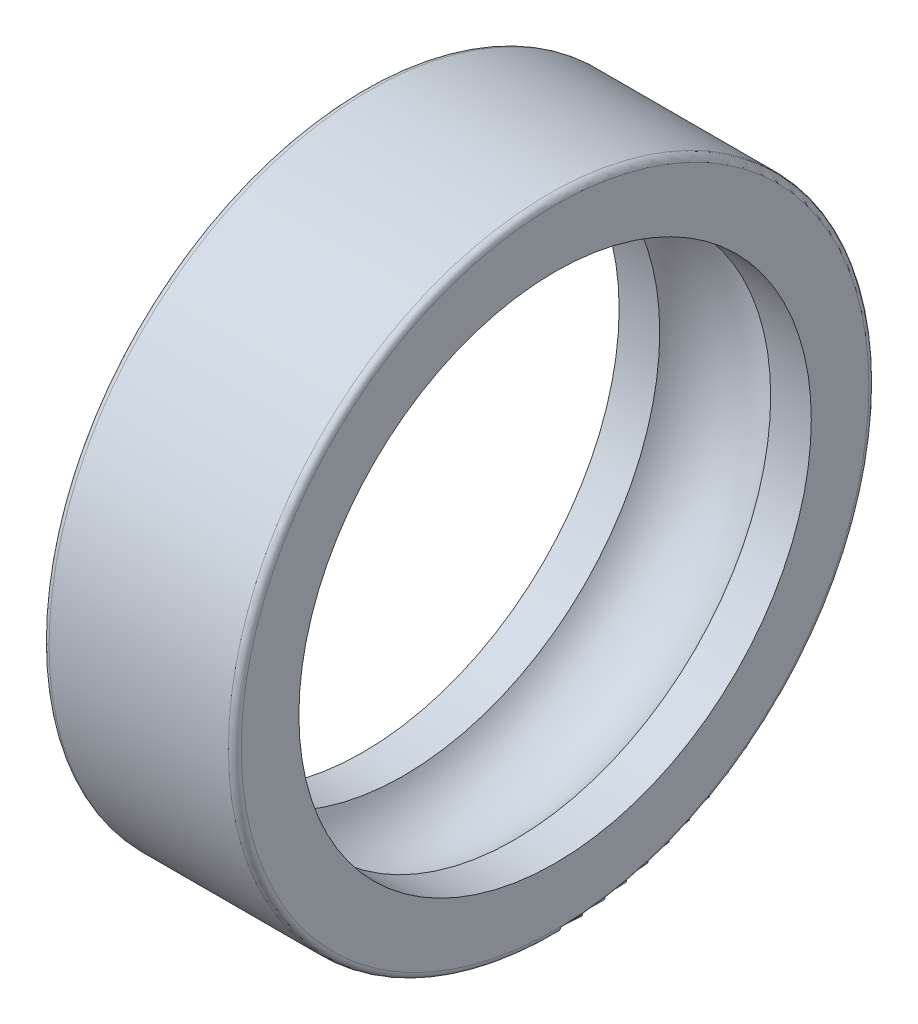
from build123d import *

# Parameters (mm, degrees)
CONG_1_R = 0.2


with BuildPart() as part:
    # Esquisse1 → Base-R_volution (revolve)
    with BuildSketch(Plane.XY, mode=Mode.PRIVATE) as base_r_volution_sk:
        with BuildLine():
            Line((-3, 8), (-1.732050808, 8))
            ThreePointArc((-1.732050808, 8), (0, 9), (1.732050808, 8))
            Line((1.732050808, 8), (3, 8))
            Line((3, 8), (3, 10))
            Line((3, 10), (-3, 10))
            Line((-3, 10), (-3, 8))
        make_face()
    revolve(base_r_volution_sk.sketch.rotate(Axis((-6, 0, 0), (1, 0, 0)), 90), axis=Axis((-6, 0, 0), (1, 0, 0)))

    # Cong_1
    cong_1_edges = [part.edges().sort_by_distance(p)[0] for p in [
        (3, 0, -10),
        (-3, 0, -10),
    ]]
    fillet(cong_1_edges, radius=CONG_1_R)


solid = part.part
